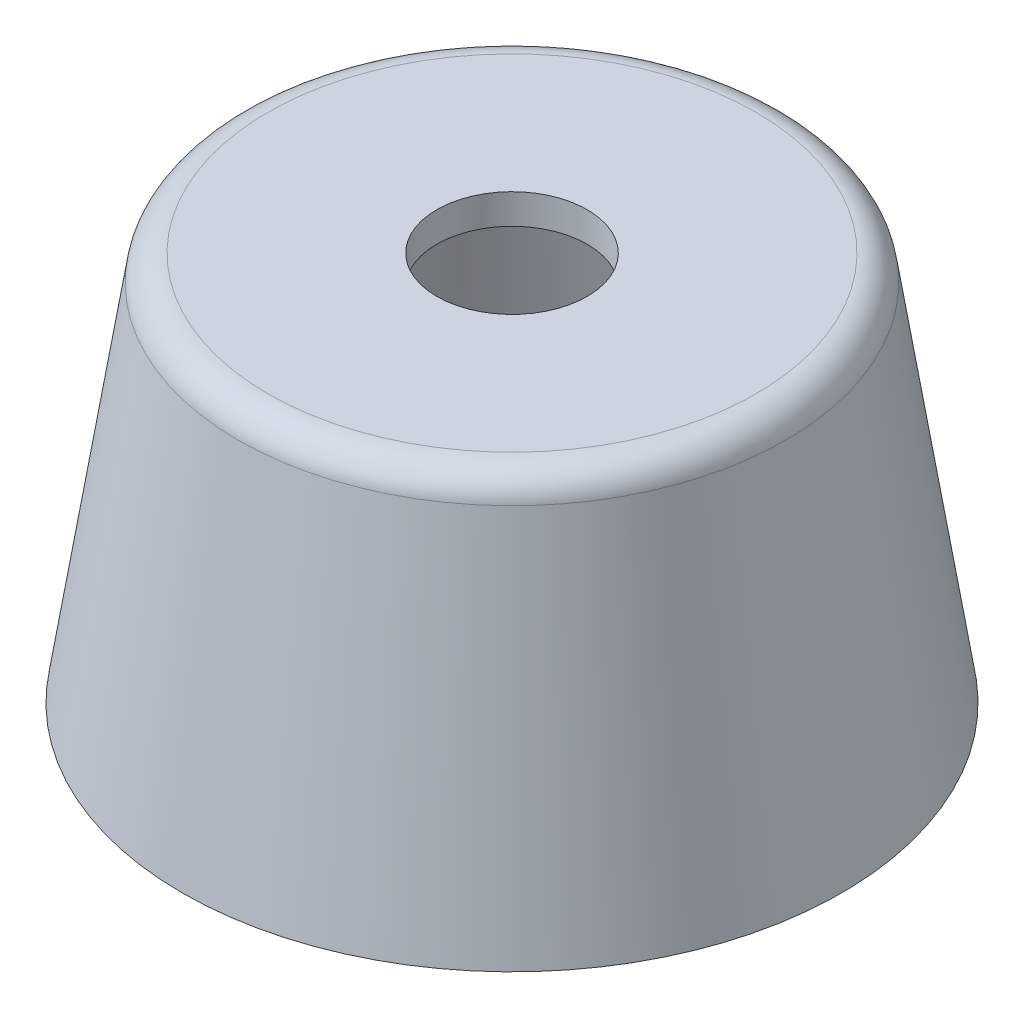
ISO-10303-21;
HEADER;
FILE_DESCRIPTION(('STEP AP214'),'2;1');
FILE_NAME('part.step','',(''),(''),'','','');
FILE_SCHEMA(('AUTOMOTIVE_DESIGN { 1 0 10303 214 1 1 1 1 }'));
ENDSEC;
DATA;
#1=APPLICATION_CONTEXT('core data for automotive mechanical design processes');
#2=APPLICATION_PROTOCOL_DEFINITION('international standard','automotive_design',2000,#1);
#3=PRODUCT_CONTEXT('',#1,'mechanical');
#4=PRODUCT('Part','Part','',(#3));
#5=PRODUCT_RELATED_PRODUCT_CATEGORY('part','',(#4));
#6=PRODUCT_DEFINITION_FORMATION('','',#4);
#7=PRODUCT_DEFINITION_CONTEXT('part definition',#1,'design');
#8=PRODUCT_DEFINITION('design','',#6,#7);
#9=PRODUCT_DEFINITION_SHAPE('','',#8);
#10=(LENGTH_UNIT() NAMED_UNIT(*) SI_UNIT(.MILLI.,.METRE.));
#11=(NAMED_UNIT(*) PLANE_ANGLE_UNIT() SI_UNIT($,.RADIAN.));
#12=(NAMED_UNIT(*) SI_UNIT($,.STERADIAN.) SOLID_ANGLE_UNIT());
#13=UNCERTAINTY_MEASURE_WITH_UNIT(LENGTH_MEASURE(1.E-05),#10,'distance_accuracy_value','');
#14=(GEOMETRIC_REPRESENTATION_CONTEXT(3) GLOBAL_UNCERTAINTY_ASSIGNED_CONTEXT((#13)) GLOBAL_UNIT_ASSIGNED_CONTEXT((#10,
#11,#12)) REPRESENTATION_CONTEXT('',''));
#15=CARTESIAN_POINT('',(0.,0.,0.));
#16=DIRECTION('',(0.,0.,1.));
#17=DIRECTION('',(1.,0.,0.));
#18=AXIS2_PLACEMENT_3D('',#15,#16,#17);
#19=CARTESIAN_POINT('',(0.,0.,0.));
#20=DIRECTION('',(0.,1.,0.));
#21=DIRECTION('',(0.,0.,1.));
#22=AXIS2_PLACEMENT_3D('',#19,#20,#21);
#23=PLANE('',#22);
#24=CARTESIAN_POINT('',(0.,0.,0.));
#25=DIRECTION('',(0.,1.,0.));
#26=DIRECTION('',(0.,0.,1.));
#27=AXIS2_PLACEMENT_3D('',#24,#25,#26);
#28=CIRCLE('',#27,49.9411744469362);
#29=CARTESIAN_POINT('',(0.,0.,49.9411744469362));
#30=VERTEX_POINT('',#29);
#31=EDGE_CURVE('E60',#30,#30,#28,.F.);
#32=ORIENTED_EDGE('',*,*,#31,.F.);
#33=EDGE_LOOP('',(#32));
#34=FACE_BOUND('',#33,.T.);
#35=CARTESIAN_POINT('',(0.,0.,0.));
#36=DIRECTION('',(0.,-1.,0.));
#37=DIRECTION('',(0.,0.,-1.));
#38=AXIS2_PLACEMENT_3D('',#35,#36,#37);
#39=CIRCLE('',#38,55.);
#40=CARTESIAN_POINT('',(0.,0.,-55.));
#41=VERTEX_POINT('',#40);
#42=EDGE_CURVE('E10',#41,#41,#39,.T.);
#43=ORIENTED_EDGE('',*,*,#42,.T.);
#44=EDGE_LOOP('',(#43));
#45=FACE_BOUND('',#44,.T.);
#46=ADVANCED_FACE('F41',(#34,#45),#23,.F.);
#47=CARTESIAN_POINT('',(0.,60.7602859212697,0.));
#48=DIRECTION('',(0.,-1.,0.));
#49=DIRECTION('',(0.,0.,-1.));
#50=AXIS2_PLACEMENT_3D('',#47,#48,#49);
#51=CONICAL_SURFACE('',#50,45.6522637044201,0.152649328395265);
#52=ORIENTED_EDGE('',*,*,#42,.F.);
#53=EDGE_LOOP('',(#52));
#54=FACE_BOUND('',#53,.T.);
#55=CARTESIAN_POINT('',(0.,60.7602859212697,0.));
#56=DIRECTION('',(0.,-1.,0.));
#57=DIRECTION('',(0.,0.,-1.));
#58=AXIS2_PLACEMENT_3D('',#55,#56,#57);
#59=CIRCLE('',#58,45.6522637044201);
#60=CARTESIAN_POINT('',(0.,60.7602859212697,-45.6522637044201));
#61=VERTEX_POINT('',#60);
#62=EDGE_CURVE('E49',#61,#61,#59,.T.);
#63=ORIENTED_EDGE('',*,*,#62,.T.);
#64=EDGE_LOOP('',(#63));
#65=FACE_BOUND('',#64,.T.);
#66=ADVANCED_FACE('F98',(#54,#65),#51,.T.);
#67=CARTESIAN_POINT('',(0.,60.,0.));
#68=DIRECTION('',(0.,-1.,0.));
#69=DIRECTION('',(0.,0.,-1.));
#70=AXIS2_PLACEMENT_3D('',#67,#68,#69);
#71=TOROIDAL_SURFACE('',#70,40.710405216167,5.);
#72=ORIENTED_EDGE('',*,*,#62,.F.);
#73=EDGE_LOOP('',(#72));
#74=FACE_BOUND('',#73,.T.);
#75=CARTESIAN_POINT('',(0.,65.,0.));
#76=DIRECTION('',(0.,-1.,0.));
#77=DIRECTION('',(0.,0.,-1.));
#78=AXIS2_PLACEMENT_3D('',#75,#76,#77);
#79=CIRCLE('',#78,40.710405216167);
#80=CARTESIAN_POINT('',(0.,65.,-40.710405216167));
#81=VERTEX_POINT('',#80);
#82=EDGE_CURVE('E54',#81,#81,#79,.T.);
#83=ORIENTED_EDGE('',*,*,#82,.T.);
#84=EDGE_LOOP('',(#83));
#85=FACE_BOUND('',#84,.T.);
#86=ADVANCED_FACE('F93',(#74,#85),#71,.T.);
#87=CARTESIAN_POINT('',(0.,65.,0.));
#88=DIRECTION('',(0.,-1.,0.));
#89=DIRECTION('',(0.,0.,-1.));
#90=AXIS2_PLACEMENT_3D('',#87,#88,#89);
#91=PLANE('',#90);
#92=CARTESIAN_POINT('',(0.,65.,0.));
#93=DIRECTION('',(0.,1.,0.));
#94=DIRECTION('',(0.,0.,1.));
#95=AXIS2_PLACEMENT_3D('',#92,#93,#94);
#96=CIRCLE('',#95,12.5490369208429);
#97=CARTESIAN_POINT('',(0.,65.,12.5490369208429));
#98=VERTEX_POINT('',#97);
#99=EDGE_CURVE('E68',#98,#98,#96,.T.);
#100=ORIENTED_EDGE('',*,*,#99,.F.);
#101=EDGE_LOOP('',(#100));
#102=FACE_BOUND('',#101,.T.);
#103=ORIENTED_EDGE('',*,*,#82,.F.);
#104=EDGE_LOOP('',(#103));
#105=FACE_BOUND('',#104,.T.);
#106=ADVANCED_FACE('F87',(#102,#105),#91,.F.);
#107=CARTESIAN_POINT('',(0.,60.,0.));
#108=DIRECTION('',(0.,-1.,0.));
#109=DIRECTION('',(0.,0.,-1.));
#110=AXIS2_PLACEMENT_3D('',#107,#108,#109);
#111=CONICAL_SURFACE('',#110,40.710405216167,0.152649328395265);
#112=ORIENTED_EDGE('',*,*,#31,.T.);
#113=EDGE_LOOP('',(#112));
#114=FACE_BOUND('',#113,.T.);
#115=CARTESIAN_POINT('',(0.,60.,0.));
#116=DIRECTION('',(0.,-1.,0.));
#117=DIRECTION('',(0.,0.,-1.));
#118=AXIS2_PLACEMENT_3D('',#115,#116,#117);
#119=CIRCLE('',#118,40.710405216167);
#120=CARTESIAN_POINT('',(0.,60.,-40.710405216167));
#121=VERTEX_POINT('',#120);
#122=EDGE_CURVE('E64',#121,#121,#119,.T.);
#123=ORIENTED_EDGE('',*,*,#122,.F.);
#124=EDGE_LOOP('',(#123));
#125=FACE_BOUND('',#124,.T.);
#126=ADVANCED_FACE('F82',(#114,#125),#111,.F.);
#127=CARTESIAN_POINT('',(0.,60.,0.));
#128=DIRECTION('',(0.,-1.,0.));
#129=DIRECTION('',(0.,0.,-1.));
#130=AXIS2_PLACEMENT_3D('',#127,#128,#129);
#131=PLANE('',#130);
#132=CARTESIAN_POINT('',(0.,60.,0.));
#133=DIRECTION('',(0.,-1.,0.));
#134=DIRECTION('',(0.,0.,-1.));
#135=AXIS2_PLACEMENT_3D('',#132,#133,#134);
#136=CIRCLE('',#135,12.5490369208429);
#137=CARTESIAN_POINT('',(0.,60.,-12.5490369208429));
#138=VERTEX_POINT('',#137);
#139=EDGE_CURVE('E44',#138,#138,#136,.T.);
#140=ORIENTED_EDGE('',*,*,#139,.F.);
#141=EDGE_LOOP('',(#140));
#142=FACE_BOUND('',#141,.T.);
#143=ORIENTED_EDGE('',*,*,#122,.T.);
#144=EDGE_LOOP('',(#143));
#145=FACE_BOUND('',#144,.T.);
#146=ADVANCED_FACE('F79',(#142,#145),#131,.T.);
#147=CARTESIAN_POINT('',(0.,55.,0.));
#148=DIRECTION('',(0.,1.,0.));
#149=DIRECTION('',(0.,0.,1.));
#150=AXIS2_PLACEMENT_3D('',#147,#148,#149);
#151=CYLINDRICAL_SURFACE('',#150,12.5490369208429);
#152=ORIENTED_EDGE('',*,*,#139,.T.);
#153=EDGE_LOOP('',(#152));
#154=FACE_BOUND('',#153,.T.);
#155=ORIENTED_EDGE('',*,*,#99,.T.);
#156=EDGE_LOOP('',(#155));
#157=FACE_BOUND('',#156,.T.);
#158=ADVANCED_FACE('F77',(#154,#157),#151,.F.);
#159=CLOSED_SHELL('',(#46,#66,#86,#106,#126,#146,#158));
#160=MANIFOLD_SOLID_BREP('B2',#159);
#161=ADVANCED_BREP_SHAPE_REPRESENTATION('',(#18,#160),#14);
#162=SHAPE_DEFINITION_REPRESENTATION(#9,#161);
ENDSEC;
END-ISO-10303-21;
